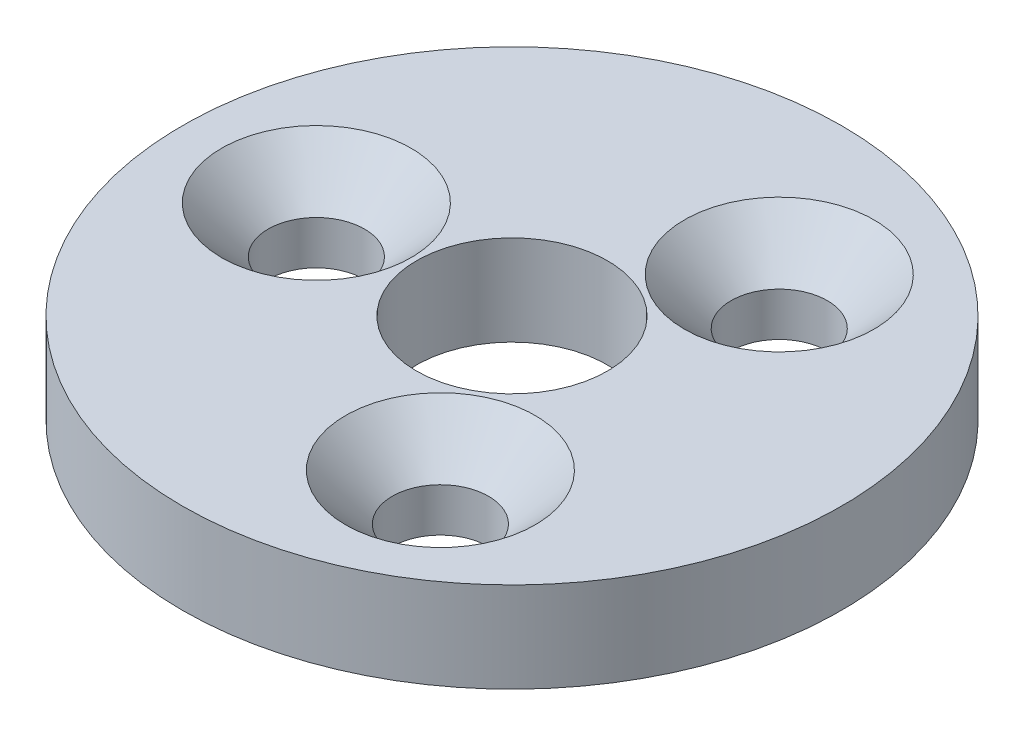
from build123d import *

# Parameters (mm, degrees)
SKETCH1_R                                    = 10.95
SKETCH1_R_2                                  = 3.175
BOSS_EXTRUDE1_DEPTH                          = 3
CSK_FOR_M3_COUNTERSUNK_RAISED_HEAD_S_2_COUNT = 2
CSK_FOR_M3_COUNTERSUNK_RAISED_HEAD_S_2_PITCH = 11.258330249
CSK_FOR_M3_COUNTERSUNK_RAISED_HEAD_S_3_COUNT = 2
CSK_FOR_M3_COUNTERSUNK_RAISED_HEAD_S_3_PITCH = 11.258330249


with BuildPart() as part:
    # Sketch1 → Boss-Extrude1 (new body)
    with BuildSketch(Plane(origin=(0, 0, 0), x_dir=(1, 0, 0), z_dir=(0, 1, 0))):
        with Locations(Location((0, 0, 0), (0, 0, 270))):
            Circle(SKETCH1_R)
        with Locations(Location((0, 0, 0), (0, 0, 270))):
            Circle(SKETCH1_R_2, mode=Mode.SUBTRACT)
    extrude(amount=BOSS_EXTRUDE1_DEPTH)

    # Sketch4 → CSK for M3 Countersunk Raised Head Screw (revolve, cut)
    with BuildSketch(Plane(origin=(-6.5, 3, 0), x_dir=(0, 0, 1), z_dir=(1, 0, 0))):
        Polygon((0, 0), (0, 3), (1.6, 3), (1.6, 1.55), (3.15, 0), align=None)
    csk_for_m3_countersunk_raised_head_screw = revolve(axis=Axis((-6.5, 9.35, 0), (0, -1, 0)), mode=Mode.SUBTRACT)

    # CSK for M3 Countersunk Raised Head S 2: CSK for M3 Countersunk Raised Head Screw ×2
    with Locations(*[Vector(0.8660254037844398, 0, -0.4999999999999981) * (i * CSK_FOR_M3_COUNTERSUNK_RAISED_HEAD_S_2_PITCH) for i in range(1, CSK_FOR_M3_COUNTERSUNK_RAISED_HEAD_S_2_COUNT)]):
        add(csk_for_m3_countersunk_raised_head_screw, mode=Mode.SUBTRACT)

    # CSK for M3 Countersunk Raised Head S 3: CSK for M3 Countersunk Raised Head Screw ×2
    with Locations(*[Vector(0.8660254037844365, 0, 0.5000000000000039) * (i * CSK_FOR_M3_COUNTERSUNK_RAISED_HEAD_S_3_PITCH) for i in range(1, CSK_FOR_M3_COUNTERSUNK_RAISED_HEAD_S_3_COUNT)]):
        add(csk_for_m3_countersunk_raised_head_screw, mode=Mode.SUBTRACT)


solid = part.part
